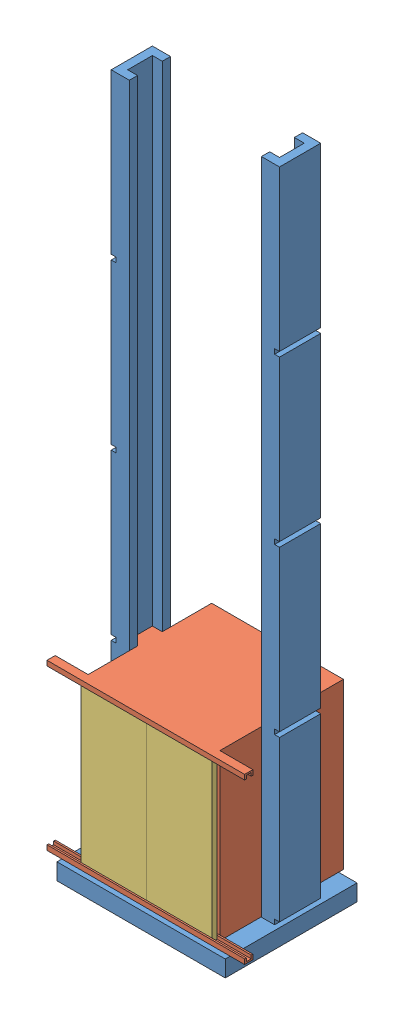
SolidWorks assembly ascenseur_simple.SLDASM, configuration Défaut (file format 7000). Lengths in mm.
Overall size (120 410 82.94).
4 component instances, 3 part files, 6 mates.
Components (placement in the parent):
- structure_ascenseur-1: structure_ascenseur.SLDPRT [Défaut] at (-223.9247 -305.9743 -2.5) x (1 0 0) z (0 1 0) size (102.2 80 410)
- cabine_ascenseur-1: cabine_ascenseur.SLDPRT [Défaut] at (-264.0247 -305.9743 -40) size (120 100 80)
- porte_ascenseur-1: porte_ascenseur.SLDPRT [Défaut] at (-264.4281 -304.9743 36) size (40 98 3)
- porte_ascenseur-2: porte_ascenseur.SLDPRT [Défaut] at (-224.7193 -304.9743 36) size (40 98 3)
Mates (geometry in assembly coordinates):
- Coïncidente1: coincident anti-aligned: plane of cabine_ascenseur-1 through (-264.0247 -322.1298 5) normal (0 0 1); plane of structure_ascenseur-1 through (-264.0247 94.0257 5) normal (0 0 -1)
- Coïncidente2: coincident anti-aligned: plane of structure_ascenseur-1 through (-270.0247 94.0257 5) normal (1 0 0); plane of cabine_ascenseur-1 through (-270.0247 -322.1298 -10) normal (-1 0 0)
- Coïncidente3: coincident anti-aligned: plane of cabine_ascenseur-1 through (-164.0247 -302.9743 36) normal (0 0 1); plane of porte_ascenseur-1 through (-264.4281 -304.9743 36) normal (0 0 -1)
- Coïncidente4: coincident anti-aligned: plane of cabine_ascenseur-1 through (-164.0247 -304.9743 36) normal (0 1 0); plane of porte_ascenseur-1 through (-264.4281 -304.9743 39) normal (0 -1 0)
- Coïncidente5: coincident anti-aligned: plane of cabine_ascenseur-1 through (-164.0247 -304.9743 36) normal (0 1 0); plane of porte_ascenseur-2 through (-224.7193 -304.9743 39) normal (0 -1 0)
- Coïncidente6: coincident anti-aligned: plane of cabine_ascenseur-1 through (-164.0247 -302.9743 36) normal (0 0 1); plane of porte_ascenseur-2 through (-224.7193 -304.9743 36) normal (0 0 -1)
